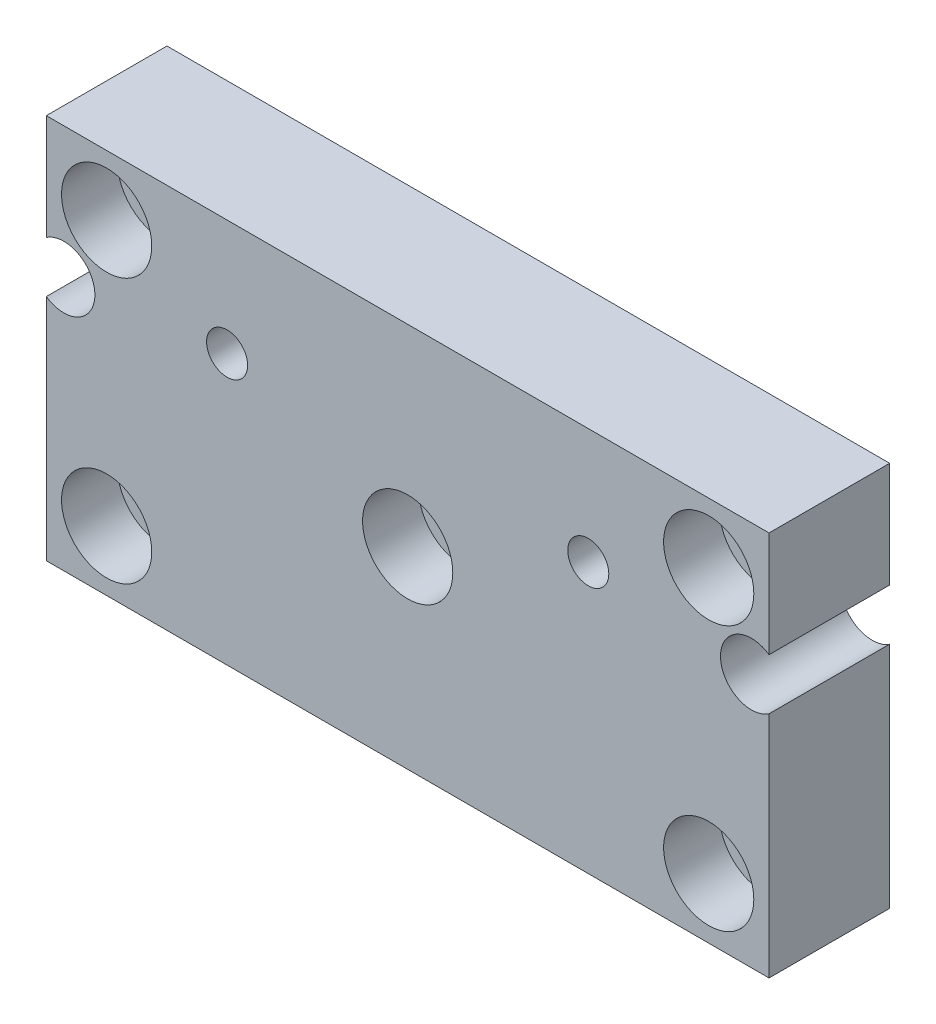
ISO-10303-21;
HEADER;
FILE_DESCRIPTION(('STEP AP214'),'2;1');
FILE_NAME('part.step','',(''),(''),'','','');
FILE_SCHEMA(('AUTOMOTIVE_DESIGN { 1 0 10303 214 1 1 1 1 }'));
ENDSEC;
DATA;
#1=APPLICATION_CONTEXT('core data for automotive mechanical design processes');
#2=APPLICATION_PROTOCOL_DEFINITION('international standard','automotive_design',2000,#1);
#3=PRODUCT_CONTEXT('',#1,'mechanical');
#4=PRODUCT('Part','Part','',(#3));
#5=PRODUCT_RELATED_PRODUCT_CATEGORY('part','',(#4));
#6=PRODUCT_DEFINITION_FORMATION('','',#4);
#7=PRODUCT_DEFINITION_CONTEXT('part definition',#1,'design');
#8=PRODUCT_DEFINITION('design','',#6,#7);
#9=PRODUCT_DEFINITION_SHAPE('','',#8);
#10=(LENGTH_UNIT() NAMED_UNIT(*) SI_UNIT(.MILLI.,.METRE.));
#11=(NAMED_UNIT(*) PLANE_ANGLE_UNIT() SI_UNIT($,.RADIAN.));
#12=(NAMED_UNIT(*) SI_UNIT($,.STERADIAN.) SOLID_ANGLE_UNIT());
#13=UNCERTAINTY_MEASURE_WITH_UNIT(LENGTH_MEASURE(1.E-05),#10,'distance_accuracy_value','');
#14=(GEOMETRIC_REPRESENTATION_CONTEXT(3) GLOBAL_UNCERTAINTY_ASSIGNED_CONTEXT((#13)) GLOBAL_UNIT_ASSIGNED_CONTEXT((#10,
#11,#12)) REPRESENTATION_CONTEXT('',''));
#15=CARTESIAN_POINT('',(0.,0.,0.));
#16=DIRECTION('',(0.,0.,1.));
#17=DIRECTION('',(1.,0.,0.));
#18=AXIS2_PLACEMENT_3D('',#15,#16,#17);
#19=CARTESIAN_POINT('',(-23.8125,12.7,-7.9502));
#20=DIRECTION('',(-1.,0.,0.));
#21=DIRECTION('',(0.,-1.,0.));
#22=AXIS2_PLACEMENT_3D('',#19,#20,#21);
#23=PLANE('',#22);
#24=DIRECTION('',(0.,0.,1.));
#25=VECTOR('',#24,1.);
#26=CARTESIAN_POINT('',(-23.8125,2.37724109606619,-7.9502));
#27=LINE('',#26,#25);
#28=CARTESIAN_POINT('',(-23.8125,2.37724109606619,-7.9502));
#29=VERTEX_POINT('',#28);
#30=CARTESIAN_POINT('',(-23.8125,2.37724109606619,0.));
#31=VERTEX_POINT('',#30);
#32=EDGE_CURVE('E50',#29,#31,#27,.T.);
#33=ORIENTED_EDGE('',*,*,#32,.F.);
#34=DIRECTION('',(0.,-1.,0.));
#35=VECTOR('',#34,1.);
#36=CARTESIAN_POINT('',(-23.8125,12.7,-7.9502));
#37=LINE('',#36,#35);
#38=CARTESIAN_POINT('',(-23.8125,-12.7,-7.9502));
#39=VERTEX_POINT('',#38);
#40=EDGE_CURVE('E115',#29,#39,#37,.T.);
#41=ORIENTED_EDGE('',*,*,#40,.T.);
#42=DIRECTION('',(0.,0.,1.));
#43=VECTOR('',#42,1.);
#44=CARTESIAN_POINT('',(-23.8125,-12.7,-7.9502));
#45=LINE('',#44,#43);
#46=CARTESIAN_POINT('',(-23.8125,-12.7,0.));
#47=VERTEX_POINT('',#46);
#48=EDGE_CURVE('E133',#39,#47,#45,.T.);
#49=ORIENTED_EDGE('',*,*,#48,.T.);
#50=DIRECTION('',(0.,-1.,0.));
#51=VECTOR('',#50,1.);
#52=CARTESIAN_POINT('',(-23.8125,12.7,0.));
#53=LINE('',#52,#51);
#54=EDGE_CURVE('E137',#31,#47,#53,.T.);
#55=ORIENTED_EDGE('',*,*,#54,.F.);
#56=EDGE_LOOP('',(#33,#41,#49,#55));
#57=FACE_BOUND('',#56,.T.);
#58=ADVANCED_FACE('F36',(#57),#23,.T.);
#59=CARTESIAN_POINT('',(23.8125,12.7,-7.9502));
#60=DIRECTION('',(1.,0.,0.));
#61=DIRECTION('',(0.,1.,0.));
#62=AXIS2_PLACEMENT_3D('',#59,#60,#61);
#63=PLANE('',#62);
#64=DIRECTION('',(0.,0.,1.));
#65=VECTOR('',#64,1.);
#66=CARTESIAN_POINT('',(23.8125,5.75075890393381,-7.9502));
#67=LINE('',#66,#65);
#68=CARTESIAN_POINT('',(23.8125,5.75075890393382,-7.9502));
#69=VERTEX_POINT('',#68);
#70=CARTESIAN_POINT('',(23.8125,5.75075890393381,0.));
#71=VERTEX_POINT('',#70);
#72=EDGE_CURVE('E58',#69,#71,#67,.T.);
#73=ORIENTED_EDGE('',*,*,#72,.F.);
#74=DIRECTION('',(0.,1.,0.));
#75=VECTOR('',#74,1.);
#76=CARTESIAN_POINT('',(23.8125,12.7,-7.9502));
#77=LINE('',#76,#75);
#78=CARTESIAN_POINT('',(23.8125,12.7,-7.9502));
#79=VERTEX_POINT('',#78);
#80=EDGE_CURVE('E121',#69,#79,#77,.T.);
#81=ORIENTED_EDGE('',*,*,#80,.T.);
#82=DIRECTION('',(0.,0.,1.));
#83=VECTOR('',#82,1.);
#84=CARTESIAN_POINT('',(23.8125,12.7,-7.9502));
#85=LINE('',#84,#83);
#86=CARTESIAN_POINT('',(23.8125,12.7,0.));
#87=VERTEX_POINT('',#86);
#88=EDGE_CURVE('E147',#79,#87,#85,.T.);
#89=ORIENTED_EDGE('',*,*,#88,.T.);
#90=DIRECTION('',(0.,1.,0.));
#91=VECTOR('',#90,1.);
#92=CARTESIAN_POINT('',(23.8125,12.7,0.));
#93=LINE('',#92,#91);
#94=EDGE_CURVE('E140',#71,#87,#93,.T.);
#95=ORIENTED_EDGE('',*,*,#94,.F.);
#96=EDGE_LOOP('',(#73,#81,#89,#95));
#97=FACE_BOUND('',#96,.T.);
#98=ADVANCED_FACE('F239',(#97),#63,.T.);
#99=CARTESIAN_POINT('',(0.,0.,-7.9502));
#100=DIRECTION('',(0.,0.,1.));
#101=DIRECTION('',(1.,0.,0.));
#102=AXIS2_PLACEMENT_3D('',#99,#100,#101);
#103=CYLINDRICAL_SURFACE('',#102,1.778);
#104=CARTESIAN_POINT('',(0.,0.,-7.9502));
#105=DIRECTION('',(0.,0.,1.));
#106=DIRECTION('',(1.,0.,0.));
#107=AXIS2_PLACEMENT_3D('',#104,#105,#106);
#108=CIRCLE('',#107,1.778);
#109=CARTESIAN_POINT('',(1.778,0.,-7.9502));
#110=VERTEX_POINT('',#109);
#111=EDGE_CURVE('E157',#110,#110,#108,.T.);
#112=ORIENTED_EDGE('',*,*,#111,.F.);
#113=EDGE_LOOP('',(#112));
#114=FACE_BOUND('',#113,.T.);
#115=CARTESIAN_POINT('',(0.,0.,-3.683));
#116=DIRECTION('',(0.,0.,1.));
#117=DIRECTION('',(1.,0.,0.));
#118=AXIS2_PLACEMENT_3D('',#115,#116,#117);
#119=CIRCLE('',#118,1.778);
#120=CARTESIAN_POINT('',(1.778,0.,-3.683));
#121=VERTEX_POINT('',#120);
#122=EDGE_CURVE('E173',#121,#121,#119,.F.);
#123=ORIENTED_EDGE('',*,*,#122,.F.);
#124=EDGE_LOOP('',(#123));
#125=FACE_BOUND('',#124,.T.);
#126=ADVANCED_FACE('F289',(#114,#125),#103,.F.);
#127=CARTESIAN_POINT('',(-19.8374,8.7249,-7.9502));
#128=DIRECTION('',(0.,0.,1.));
#129=DIRECTION('',(1.,0.,0.));
#130=AXIS2_PLACEMENT_3D('',#127,#128,#129);
#131=CYLINDRICAL_SURFACE('',#130,1.778);
#132=CARTESIAN_POINT('',(-19.8374,8.7249,-7.9502));
#133=DIRECTION('',(0.,0.,1.));
#134=DIRECTION('',(1.,0.,0.));
#135=AXIS2_PLACEMENT_3D('',#132,#133,#134);
#136=CIRCLE('',#135,1.778);
#137=CARTESIAN_POINT('',(-18.0594,8.7249,-7.9502));
#138=VERTEX_POINT('',#137);
#139=EDGE_CURVE('E207',#138,#138,#136,.T.);
#140=ORIENTED_EDGE('',*,*,#139,.F.);
#141=EDGE_LOOP('',(#140));
#142=FACE_BOUND('',#141,.T.);
#143=CARTESIAN_POINT('',(-19.8374,8.7249,-3.683));
#144=DIRECTION('',(0.,0.,1.));
#145=DIRECTION('',(1.,0.,0.));
#146=AXIS2_PLACEMENT_3D('',#143,#144,#145);
#147=CIRCLE('',#146,1.778);
#148=CARTESIAN_POINT('',(-18.0594,8.7249,-3.683));
#149=VERTEX_POINT('',#148);
#150=EDGE_CURVE('E169',#149,#149,#147,.F.);
#151=ORIENTED_EDGE('',*,*,#150,.F.);
#152=EDGE_LOOP('',(#151));
#153=FACE_BOUND('',#152,.T.);
#154=ADVANCED_FACE('F468',(#142,#153),#131,.F.);
#155=CARTESIAN_POINT('',(-19.8374,-8.7249,-7.9502));
#156=DIRECTION('',(0.,0.,1.));
#157=DIRECTION('',(1.,0.,0.));
#158=AXIS2_PLACEMENT_3D('',#155,#156,#157);
#159=CYLINDRICAL_SURFACE('',#158,1.778);
#160=CARTESIAN_POINT('',(-19.8374,-8.7249,-7.9502));
#161=DIRECTION('',(0.,0.,1.));
#162=DIRECTION('',(1.,0.,0.));
#163=AXIS2_PLACEMENT_3D('',#160,#161,#162);
#164=CIRCLE('',#163,1.778);
#165=CARTESIAN_POINT('',(-18.0594,-8.7249,-7.9502));
#166=VERTEX_POINT('',#165);
#167=EDGE_CURVE('E210',#166,#166,#164,.T.);
#168=ORIENTED_EDGE('',*,*,#167,.F.);
#169=EDGE_LOOP('',(#168));
#170=FACE_BOUND('',#169,.T.);
#171=CARTESIAN_POINT('',(-19.8374,-8.7249,-3.683));
#172=DIRECTION('',(0.,0.,1.));
#173=DIRECTION('',(1.,0.,0.));
#174=AXIS2_PLACEMENT_3D('',#171,#172,#173);
#175=CIRCLE('',#174,1.778);
#176=CARTESIAN_POINT('',(-18.0594,-8.7249,-3.683));
#177=VERTEX_POINT('',#176);
#178=EDGE_CURVE('E164',#177,#177,#175,.F.);
#179=ORIENTED_EDGE('',*,*,#178,.F.);
#180=EDGE_LOOP('',(#179));
#181=FACE_BOUND('',#180,.T.);
#182=ADVANCED_FACE('F304',(#170,#181),#159,.F.);
#183=CARTESIAN_POINT('',(19.8374,-8.7249,-7.9502));
#184=DIRECTION('',(0.,0.,1.));
#185=DIRECTION('',(1.,0.,0.));
#186=AXIS2_PLACEMENT_3D('',#183,#184,#185);
#187=CYLINDRICAL_SURFACE('',#186,1.778);
#188=CARTESIAN_POINT('',(19.8374,-8.7249,-7.9502));
#189=DIRECTION('',(0.,0.,1.));
#190=DIRECTION('',(1.,0.,0.));
#191=AXIS2_PLACEMENT_3D('',#188,#189,#190);
#192=CIRCLE('',#191,1.778);
#193=CARTESIAN_POINT('',(21.6154,-8.7249,-7.9502));
#194=VERTEX_POINT('',#193);
#195=EDGE_CURVE('E212',#194,#194,#192,.T.);
#196=ORIENTED_EDGE('',*,*,#195,.F.);
#197=EDGE_LOOP('',(#196));
#198=FACE_BOUND('',#197,.T.);
#199=CARTESIAN_POINT('',(19.8374,-8.7249,-3.683));
#200=DIRECTION('',(0.,0.,1.));
#201=DIRECTION('',(1.,0.,0.));
#202=AXIS2_PLACEMENT_3D('',#199,#200,#201);
#203=CIRCLE('',#202,1.778);
#204=CARTESIAN_POINT('',(21.6154,-8.7249,-3.683));
#205=VERTEX_POINT('',#204);
#206=EDGE_CURVE('E159',#205,#205,#203,.F.);
#207=ORIENTED_EDGE('',*,*,#206,.F.);
#208=EDGE_LOOP('',(#207));
#209=FACE_BOUND('',#208,.T.);
#210=ADVANCED_FACE('F298',(#198,#209),#187,.F.);
#211=CARTESIAN_POINT('',(19.8374,8.7249,-7.9502));
#212=DIRECTION('',(0.,0.,1.));
#213=DIRECTION('',(1.,0.,0.));
#214=AXIS2_PLACEMENT_3D('',#211,#212,#213);
#215=CYLINDRICAL_SURFACE('',#214,1.778);
#216=CARTESIAN_POINT('',(19.8374,8.7249,-7.9502));
#217=DIRECTION('',(0.,0.,1.));
#218=DIRECTION('',(1.,0.,0.));
#219=AXIS2_PLACEMENT_3D('',#216,#217,#218);
#220=CIRCLE('',#219,1.778);
#221=CARTESIAN_POINT('',(21.6154,8.7249,-7.9502));
#222=VERTEX_POINT('',#221);
#223=EDGE_CURVE('E125',#222,#222,#220,.T.);
#224=ORIENTED_EDGE('',*,*,#223,.F.);
#225=EDGE_LOOP('',(#224));
#226=FACE_BOUND('',#225,.T.);
#227=CARTESIAN_POINT('',(19.8374,8.7249,-3.683));
#228=DIRECTION('',(0.,0.,1.));
#229=DIRECTION('',(1.,0.,0.));
#230=AXIS2_PLACEMENT_3D('',#227,#228,#229);
#231=CIRCLE('',#230,1.778);
#232=CARTESIAN_POINT('',(21.6154,8.7249,-3.683));
#233=VERTEX_POINT('',#232);
#234=EDGE_CURVE('E154',#233,#233,#231,.F.);
#235=ORIENTED_EDGE('',*,*,#234,.F.);
#236=EDGE_LOOP('',(#235));
#237=FACE_BOUND('',#236,.T.);
#238=ADVANCED_FACE('F292',(#226,#237),#215,.F.);
#239=DIRECTION('',(0.,0.,1.));
#240=VECTOR('',#239,1.);
#241=CARTESIAN_POINT('',(-23.8125,5.75075890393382,-7.9502));
#242=LINE('',#241,#240);
#243=CARTESIAN_POINT('',(-23.8125,5.75075890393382,0.));
#244=VERTEX_POINT('',#243);
#245=CARTESIAN_POINT('',(-23.8125,5.75075890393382,-7.9502));
#246=VERTEX_POINT('',#245);
#247=EDGE_CURVE('E98',#244,#246,#242,.F.);
#248=ORIENTED_EDGE('',*,*,#247,.F.);
#249=CARTESIAN_POINT('',(-23.8125,12.7,0.));
#250=VERTEX_POINT('',#249);
#251=EDGE_CURVE('E134',#250,#244,#53,.T.);
#252=ORIENTED_EDGE('',*,*,#251,.F.);
#253=DIRECTION('',(0.,0.,1.));
#254=VECTOR('',#253,1.);
#255=CARTESIAN_POINT('',(-23.8125,12.7,-7.9502));
#256=LINE('',#255,#254);
#257=CARTESIAN_POINT('',(-23.8125,12.7,-7.9502));
#258=VERTEX_POINT('',#257);
#259=EDGE_CURVE('E44',#258,#250,#256,.T.);
#260=ORIENTED_EDGE('',*,*,#259,.F.);
#261=EDGE_CURVE('E112',#258,#246,#37,.T.);
#262=ORIENTED_EDGE('',*,*,#261,.T.);
#263=EDGE_LOOP('',(#248,#252,#260,#262));
#264=FACE_BOUND('',#263,.T.);
#265=ADVANCED_FACE('F38',(#264),#23,.T.);
#266=CARTESIAN_POINT('',(-23.8125,12.7,-7.9502));
#267=DIRECTION('',(0.,1.,0.));
#268=DIRECTION('',(-1.,0.,0.));
#269=AXIS2_PLACEMENT_3D('',#266,#267,#268);
#270=PLANE('',#269);
#271=DIRECTION('',(-1.,0.,0.));
#272=VECTOR('',#271,1.);
#273=CARTESIAN_POINT('',(-23.8125,12.7,0.));
#274=LINE('',#273,#272);
#275=EDGE_CURVE('E123',#87,#250,#274,.T.);
#276=ORIENTED_EDGE('',*,*,#275,.F.);
#277=ORIENTED_EDGE('',*,*,#88,.F.);
#278=DIRECTION('',(-1.,0.,0.));
#279=VECTOR('',#278,1.);
#280=CARTESIAN_POINT('',(-23.8125,12.7,-7.9502));
#281=LINE('',#280,#279);
#282=EDGE_CURVE('E131',#79,#258,#281,.T.);
#283=ORIENTED_EDGE('',*,*,#282,.T.);
#284=ORIENTED_EDGE('',*,*,#259,.T.);
#285=EDGE_LOOP('',(#276,#277,#283,#284));
#286=FACE_BOUND('',#285,.T.);
#287=ADVANCED_FACE('F244',(#286),#270,.T.);
#288=DIRECTION('',(0.,0.,1.));
#289=VECTOR('',#288,1.);
#290=CARTESIAN_POINT('',(23.8125,2.37724109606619,-7.9502));
#291=LINE('',#290,#289);
#292=CARTESIAN_POINT('',(23.8125,2.37724109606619,0.));
#293=VERTEX_POINT('',#292);
#294=CARTESIAN_POINT('',(23.8125,2.37724109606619,-7.9502));
#295=VERTEX_POINT('',#294);
#296=EDGE_CURVE('E233',#293,#295,#291,.F.);
#297=ORIENTED_EDGE('',*,*,#296,.F.);
#298=CARTESIAN_POINT('',(23.8125,-12.7,0.));
#299=VERTEX_POINT('',#298);
#300=EDGE_CURVE('E141',#299,#293,#93,.T.);
#301=ORIENTED_EDGE('',*,*,#300,.F.);
#302=DIRECTION('',(0.,0.,1.));
#303=VECTOR('',#302,1.);
#304=CARTESIAN_POINT('',(23.8125,-12.7,-7.9502));
#305=LINE('',#304,#303);
#306=CARTESIAN_POINT('',(23.8125,-12.7,-7.9502));
#307=VERTEX_POINT('',#306);
#308=EDGE_CURVE('E150',#307,#299,#305,.T.);
#309=ORIENTED_EDGE('',*,*,#308,.F.);
#310=EDGE_CURVE('E128',#307,#295,#77,.T.);
#311=ORIENTED_EDGE('',*,*,#310,.T.);
#312=EDGE_LOOP('',(#297,#301,#309,#311));
#313=FACE_BOUND('',#312,.T.);
#314=ADVANCED_FACE('F232',(#313),#63,.T.);
#315=CARTESIAN_POINT('',(-23.8125,-12.7,-7.9502));
#316=DIRECTION('',(0.,-1.,0.));
#317=DIRECTION('',(1.,0.,0.));
#318=AXIS2_PLACEMENT_3D('',#315,#316,#317);
#319=PLANE('',#318);
#320=DIRECTION('',(1.,0.,0.));
#321=VECTOR('',#320,1.);
#322=CARTESIAN_POINT('',(-23.8125,-12.7,0.));
#323=LINE('',#322,#321);
#324=EDGE_CURVE('E136',#47,#299,#323,.T.);
#325=ORIENTED_EDGE('',*,*,#324,.F.);
#326=ORIENTED_EDGE('',*,*,#48,.F.);
#327=DIRECTION('',(1.,0.,0.));
#328=VECTOR('',#327,1.);
#329=CARTESIAN_POINT('',(-23.8125,-12.7,-7.9502));
#330=LINE('',#329,#328);
#331=EDGE_CURVE('E118',#39,#307,#330,.T.);
#332=ORIENTED_EDGE('',*,*,#331,.T.);
#333=ORIENTED_EDGE('',*,*,#308,.T.);
#334=EDGE_LOOP('',(#325,#326,#332,#333));
#335=FACE_BOUND('',#334,.T.);
#336=ADVANCED_FACE('F227',(#335),#319,.T.);
#337=CARTESIAN_POINT('',(-23.8125,-12.7,-7.9502));
#338=DIRECTION('',(0.,0.,1.));
#339=DIRECTION('',(1.,0.,0.));
#340=AXIS2_PLACEMENT_3D('',#337,#338,#339);
#341=PLANE('',#340);
#342=CARTESIAN_POINT('',(-11.8999,5.07999999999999,-7.9502));
#343=DIRECTION('',(0.,0.,1.));
#344=DIRECTION('',(1.,0.,0.));
#345=AXIS2_PLACEMENT_3D('',#342,#343,#344);
#346=CIRCLE('',#345,1.35255);
#347=CARTESIAN_POINT('',(-10.54735,5.07999999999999,-7.9502));
#348=VERTEX_POINT('',#347);
#349=EDGE_CURVE('E257',#348,#348,#346,.T.);
#350=ORIENTED_EDGE('',*,*,#349,.T.);
#351=EDGE_LOOP('',(#350));
#352=FACE_BOUND('',#351,.T.);
#353=CARTESIAN_POINT('',(11.8999,5.07999999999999,-7.9502));
#354=DIRECTION('',(0.,0.,1.));
#355=DIRECTION('',(1.,0.,0.));
#356=AXIS2_PLACEMENT_3D('',#353,#354,#355);
#357=CIRCLE('',#356,1.35255);
#358=CARTESIAN_POINT('',(13.25245,5.07999999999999,-7.9502));
#359=VERTEX_POINT('',#358);
#360=EDGE_CURVE('E251',#359,#359,#357,.T.);
#361=ORIENTED_EDGE('',*,*,#360,.T.);
#362=EDGE_LOOP('',(#361));
#363=FACE_BOUND('',#362,.T.);
#364=ORIENTED_EDGE('',*,*,#111,.T.);
#365=EDGE_LOOP('',(#364));
#366=FACE_BOUND('',#365,.T.);
#367=ORIENTED_EDGE('',*,*,#139,.T.);
#368=EDGE_LOOP('',(#367));
#369=FACE_BOUND('',#368,.T.);
#370=ORIENTED_EDGE('',*,*,#167,.T.);
#371=EDGE_LOOP('',(#370));
#372=FACE_BOUND('',#371,.T.);
#373=ORIENTED_EDGE('',*,*,#195,.T.);
#374=EDGE_LOOP('',(#373));
#375=FACE_BOUND('',#374,.T.);
#376=ORIENTED_EDGE('',*,*,#223,.T.);
#377=EDGE_LOOP('',(#376));
#378=FACE_BOUND('',#377,.T.);
#379=ORIENTED_EDGE('',*,*,#40,.F.);
#380=CARTESIAN_POINT('',(-22.6568,4.064,-7.9502));
#381=DIRECTION('',(0.,0.,1.));
#382=DIRECTION('',(1.,0.,0.));
#383=AXIS2_PLACEMENT_3D('',#380,#381,#382);
#384=CIRCLE('',#383,2.0447);
#385=EDGE_CURVE('E101',#29,#246,#384,.T.);
#386=ORIENTED_EDGE('',*,*,#385,.T.);
#387=ORIENTED_EDGE('',*,*,#261,.F.);
#388=ORIENTED_EDGE('',*,*,#282,.F.);
#389=ORIENTED_EDGE('',*,*,#80,.F.);
#390=CARTESIAN_POINT('',(22.6568,4.064,-7.9502));
#391=DIRECTION('',(0.,0.,1.));
#392=DIRECTION('',(1.,0.,0.));
#393=AXIS2_PLACEMENT_3D('',#390,#391,#392);
#394=CIRCLE('',#393,2.0447);
#395=EDGE_CURVE('E236',#69,#295,#394,.T.);
#396=ORIENTED_EDGE('',*,*,#395,.T.);
#397=ORIENTED_EDGE('',*,*,#310,.F.);
#398=ORIENTED_EDGE('',*,*,#331,.F.);
#399=EDGE_LOOP('',(#379,#386,#387,#388,#389,#396,#397,#398));
#400=FACE_BOUND('',#399,.T.);
#401=ADVANCED_FACE('F110',(#352,#363,#366,#369,#372,#375,#378,#400),#341,.F.);
#402=CARTESIAN_POINT('',(-23.8125,-12.7,0.));
#403=DIRECTION('',(0.,0.,1.));
#404=DIRECTION('',(1.,0.,0.));
#405=AXIS2_PLACEMENT_3D('',#402,#403,#404);
#406=PLANE('',#405);
#407=CARTESIAN_POINT('',(-11.8999,5.07999999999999,0.));
#408=DIRECTION('',(0.,0.,1.));
#409=DIRECTION('',(1.,0.,0.));
#410=AXIS2_PLACEMENT_3D('',#407,#408,#409);
#411=CIRCLE('',#410,1.35254999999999);
#412=CARTESIAN_POINT('',(-10.54735,5.07999999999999,0.));
#413=VERTEX_POINT('',#412);
#414=EDGE_CURVE('E254',#413,#413,#411,.T.);
#415=ORIENTED_EDGE('',*,*,#414,.F.);
#416=EDGE_LOOP('',(#415));
#417=FACE_BOUND('',#416,.T.);
#418=CARTESIAN_POINT('',(11.8999,5.07999999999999,0.));
#419=DIRECTION('',(0.,0.,1.));
#420=DIRECTION('',(1.,0.,0.));
#421=AXIS2_PLACEMENT_3D('',#418,#419,#420);
#422=CIRCLE('',#421,1.35254999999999);
#423=CARTESIAN_POINT('',(13.25245,5.07999999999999,0.));
#424=VERTEX_POINT('',#423);
#425=EDGE_CURVE('E116',#424,#424,#422,.T.);
#426=ORIENTED_EDGE('',*,*,#425,.F.);
#427=EDGE_LOOP('',(#426));
#428=FACE_BOUND('',#427,.T.);
#429=CARTESIAN_POINT('',(-22.6568,4.064,0.));
#430=DIRECTION('',(0.,0.,1.));
#431=DIRECTION('',(1.,0.,0.));
#432=AXIS2_PLACEMENT_3D('',#429,#430,#431);
#433=CIRCLE('',#432,2.0447);
#434=EDGE_CURVE('E11',#31,#244,#433,.T.);
#435=ORIENTED_EDGE('',*,*,#434,.F.);
#436=ORIENTED_EDGE('',*,*,#54,.T.);
#437=ORIENTED_EDGE('',*,*,#324,.T.);
#438=ORIENTED_EDGE('',*,*,#300,.T.);
#439=CARTESIAN_POINT('',(22.6568,4.064,0.));
#440=DIRECTION('',(0.,0.,1.));
#441=DIRECTION('',(1.,0.,0.));
#442=AXIS2_PLACEMENT_3D('',#439,#440,#441);
#443=CIRCLE('',#442,2.0447);
#444=EDGE_CURVE('E234',#71,#293,#443,.T.);
#445=ORIENTED_EDGE('',*,*,#444,.F.);
#446=ORIENTED_EDGE('',*,*,#94,.T.);
#447=ORIENTED_EDGE('',*,*,#275,.T.);
#448=ORIENTED_EDGE('',*,*,#251,.T.);
#449=EDGE_LOOP('',(#435,#436,#437,#438,#445,#446,#447,#448));
#450=FACE_BOUND('',#449,.T.);
#451=CARTESIAN_POINT('',(0.,0.,0.));
#452=DIRECTION('',(0.,0.,1.));
#453=DIRECTION('',(1.,0.,0.));
#454=AXIS2_PLACEMENT_3D('',#451,#452,#453);
#455=CIRCLE('',#454,2.9718);
#456=CARTESIAN_POINT('',(2.9718,0.,0.));
#457=VERTEX_POINT('',#456);
#458=EDGE_CURVE('E182',#457,#457,#455,.T.);
#459=ORIENTED_EDGE('',*,*,#458,.F.);
#460=EDGE_LOOP('',(#459));
#461=FACE_BOUND('',#460,.T.);
#462=CARTESIAN_POINT('',(-19.8374,8.7249,0.));
#463=DIRECTION('',(0.,0.,1.));
#464=DIRECTION('',(1.,0.,0.));
#465=AXIS2_PLACEMENT_3D('',#462,#463,#464);
#466=CIRCLE('',#465,2.9718);
#467=CARTESIAN_POINT('',(-16.8656,8.7249,0.));
#468=VERTEX_POINT('',#467);
#469=EDGE_CURVE('E175',#468,#468,#466,.T.);
#470=ORIENTED_EDGE('',*,*,#469,.F.);
#471=EDGE_LOOP('',(#470));
#472=FACE_BOUND('',#471,.T.);
#473=CARTESIAN_POINT('',(-19.8374,-8.7249,0.));
#474=DIRECTION('',(0.,0.,1.));
#475=DIRECTION('',(1.,0.,0.));
#476=AXIS2_PLACEMENT_3D('',#473,#474,#475);
#477=CIRCLE('',#476,2.9718);
#478=CARTESIAN_POINT('',(-16.8656,-8.7249,0.));
#479=VERTEX_POINT('',#478);
#480=EDGE_CURVE('E171',#479,#479,#477,.T.);
#481=ORIENTED_EDGE('',*,*,#480,.F.);
#482=EDGE_LOOP('',(#481));
#483=FACE_BOUND('',#482,.T.);
#484=CARTESIAN_POINT('',(19.8374,-8.7249,0.));
#485=DIRECTION('',(0.,0.,1.));
#486=DIRECTION('',(1.,0.,0.));
#487=AXIS2_PLACEMENT_3D('',#484,#485,#486);
#488=CIRCLE('',#487,2.9718);
#489=CARTESIAN_POINT('',(22.8092,-8.7249,0.));
#490=VERTEX_POINT('',#489);
#491=EDGE_CURVE('E167',#490,#490,#488,.T.);
#492=ORIENTED_EDGE('',*,*,#491,.F.);
#493=EDGE_LOOP('',(#492));
#494=FACE_BOUND('',#493,.T.);
#495=CARTESIAN_POINT('',(19.8374,8.7249,0.));
#496=DIRECTION('',(0.,0.,1.));
#497=DIRECTION('',(1.,0.,0.));
#498=AXIS2_PLACEMENT_3D('',#495,#496,#497);
#499=CIRCLE('',#498,2.9718);
#500=CARTESIAN_POINT('',(22.8092,8.7249,0.));
#501=VERTEX_POINT('',#500);
#502=EDGE_CURVE('E162',#501,#501,#499,.T.);
#503=ORIENTED_EDGE('',*,*,#502,.F.);
#504=EDGE_LOOP('',(#503));
#505=FACE_BOUND('',#504,.T.);
#506=ADVANCED_FACE('F221',(#417,#428,#450,#461,#472,#483,#494,#505),#406,.T.);
#507=CARTESIAN_POINT('',(19.8374,8.7249,-3.683));
#508=DIRECTION('',(0.,0.,1.));
#509=DIRECTION('',(1.,0.,0.));
#510=AXIS2_PLACEMENT_3D('',#507,#508,#509);
#511=PLANE('',#510);
#512=CARTESIAN_POINT('',(19.8374,8.7249,-3.683));
#513=DIRECTION('',(0.,0.,1.));
#514=DIRECTION('',(1.,0.,0.));
#515=AXIS2_PLACEMENT_3D('',#512,#513,#514);
#516=CIRCLE('',#515,2.9718);
#517=CARTESIAN_POINT('',(22.8092,8.7249,-3.683));
#518=VERTEX_POINT('',#517);
#519=EDGE_CURVE('E158',#518,#518,#516,.T.);
#520=ORIENTED_EDGE('',*,*,#519,.T.);
#521=EDGE_LOOP('',(#520));
#522=FACE_BOUND('',#521,.T.);
#523=ORIENTED_EDGE('',*,*,#234,.T.);
#524=EDGE_LOOP('',(#523));
#525=FACE_BOUND('',#524,.T.);
#526=ADVANCED_FACE('F272',(#522,#525),#511,.T.);
#527=CARTESIAN_POINT('',(19.8374,8.7249,-3.683));
#528=DIRECTION('',(0.,0.,1.));
#529=DIRECTION('',(1.,0.,0.));
#530=AXIS2_PLACEMENT_3D('',#527,#528,#529);
#531=CYLINDRICAL_SURFACE('',#530,2.9718);
#532=ORIENTED_EDGE('',*,*,#519,.F.);
#533=EDGE_LOOP('',(#532));
#534=FACE_BOUND('',#533,.T.);
#535=ORIENTED_EDGE('',*,*,#502,.T.);
#536=EDGE_LOOP('',(#535));
#537=FACE_BOUND('',#536,.T.);
#538=ADVANCED_FACE('F335',(#534,#537),#531,.F.);
#539=CARTESIAN_POINT('',(19.8374,-8.7249,-3.683));
#540=DIRECTION('',(0.,0.,1.));
#541=DIRECTION('',(1.,0.,0.));
#542=AXIS2_PLACEMENT_3D('',#539,#540,#541);
#543=PLANE('',#542);
#544=CARTESIAN_POINT('',(19.8374,-8.7249,-3.683));
#545=DIRECTION('',(0.,0.,1.));
#546=DIRECTION('',(1.,0.,0.));
#547=AXIS2_PLACEMENT_3D('',#544,#545,#546);
#548=CIRCLE('',#547,2.9718);
#549=CARTESIAN_POINT('',(22.8092,-8.7249,-3.683));
#550=VERTEX_POINT('',#549);
#551=EDGE_CURVE('E163',#550,#550,#548,.T.);
#552=ORIENTED_EDGE('',*,*,#551,.T.);
#553=EDGE_LOOP('',(#552));
#554=FACE_BOUND('',#553,.T.);
#555=ORIENTED_EDGE('',*,*,#206,.T.);
#556=EDGE_LOOP('',(#555));
#557=FACE_BOUND('',#556,.T.);
#558=ADVANCED_FACE('F343',(#554,#557),#543,.T.);
#559=CARTESIAN_POINT('',(19.8374,-8.7249,-3.683));
#560=DIRECTION('',(0.,0.,1.));
#561=DIRECTION('',(1.,0.,0.));
#562=AXIS2_PLACEMENT_3D('',#559,#560,#561);
#563=CYLINDRICAL_SURFACE('',#562,2.9718);
#564=ORIENTED_EDGE('',*,*,#551,.F.);
#565=EDGE_LOOP('',(#564));
#566=FACE_BOUND('',#565,.T.);
#567=ORIENTED_EDGE('',*,*,#491,.T.);
#568=EDGE_LOOP('',(#567));
#569=FACE_BOUND('',#568,.T.);
#570=ADVANCED_FACE('F351',(#566,#569),#563,.F.);
#571=CARTESIAN_POINT('',(-19.8374,-8.7249,-3.683));
#572=DIRECTION('',(0.,0.,1.));
#573=DIRECTION('',(1.,0.,0.));
#574=AXIS2_PLACEMENT_3D('',#571,#572,#573);
#575=PLANE('',#574);
#576=CARTESIAN_POINT('',(-19.8374,-8.7249,-3.683));
#577=DIRECTION('',(0.,0.,1.));
#578=DIRECTION('',(1.,0.,0.));
#579=AXIS2_PLACEMENT_3D('',#576,#577,#578);
#580=CIRCLE('',#579,2.9718);
#581=CARTESIAN_POINT('',(-16.8656,-8.7249,-3.683));
#582=VERTEX_POINT('',#581);
#583=EDGE_CURVE('E168',#582,#582,#580,.T.);
#584=ORIENTED_EDGE('',*,*,#583,.T.);
#585=EDGE_LOOP('',(#584));
#586=FACE_BOUND('',#585,.T.);
#587=ORIENTED_EDGE('',*,*,#178,.T.);
#588=EDGE_LOOP('',(#587));
#589=FACE_BOUND('',#588,.T.);
#590=ADVANCED_FACE('F359',(#586,#589),#575,.T.);
#591=CARTESIAN_POINT('',(-19.8374,-8.7249,-3.683));
#592=DIRECTION('',(0.,0.,1.));
#593=DIRECTION('',(1.,0.,0.));
#594=AXIS2_PLACEMENT_3D('',#591,#592,#593);
#595=CYLINDRICAL_SURFACE('',#594,2.9718);
#596=ORIENTED_EDGE('',*,*,#583,.F.);
#597=EDGE_LOOP('',(#596));
#598=FACE_BOUND('',#597,.T.);
#599=ORIENTED_EDGE('',*,*,#480,.T.);
#600=EDGE_LOOP('',(#599));
#601=FACE_BOUND('',#600,.T.);
#602=ADVANCED_FACE('F367',(#598,#601),#595,.F.);
#603=CARTESIAN_POINT('',(-19.8374,8.7249,-3.683));
#604=DIRECTION('',(0.,0.,1.));
#605=DIRECTION('',(1.,0.,0.));
#606=AXIS2_PLACEMENT_3D('',#603,#604,#605);
#607=PLANE('',#606);
#608=CARTESIAN_POINT('',(-19.8374,8.7249,-3.683));
#609=DIRECTION('',(0.,0.,1.));
#610=DIRECTION('',(1.,0.,0.));
#611=AXIS2_PLACEMENT_3D('',#608,#609,#610);
#612=CIRCLE('',#611,2.9718);
#613=CARTESIAN_POINT('',(-16.8656,8.7249,-3.683));
#614=VERTEX_POINT('',#613);
#615=EDGE_CURVE('E172',#614,#614,#612,.T.);
#616=ORIENTED_EDGE('',*,*,#615,.T.);
#617=EDGE_LOOP('',(#616));
#618=FACE_BOUND('',#617,.T.);
#619=ORIENTED_EDGE('',*,*,#150,.T.);
#620=EDGE_LOOP('',(#619));
#621=FACE_BOUND('',#620,.T.);
#622=ADVANCED_FACE('F375',(#618,#621),#607,.T.);
#623=CARTESIAN_POINT('',(-19.8374,8.7249,-3.683));
#624=DIRECTION('',(0.,0.,1.));
#625=DIRECTION('',(1.,0.,0.));
#626=AXIS2_PLACEMENT_3D('',#623,#624,#625);
#627=CYLINDRICAL_SURFACE('',#626,2.9718);
#628=ORIENTED_EDGE('',*,*,#615,.F.);
#629=EDGE_LOOP('',(#628));
#630=FACE_BOUND('',#629,.T.);
#631=ORIENTED_EDGE('',*,*,#469,.T.);
#632=EDGE_LOOP('',(#631));
#633=FACE_BOUND('',#632,.T.);
#634=ADVANCED_FACE('F383',(#630,#633),#627,.F.);
#635=CARTESIAN_POINT('',(0.,0.,-3.683));
#636=DIRECTION('',(0.,0.,1.));
#637=DIRECTION('',(1.,0.,0.));
#638=AXIS2_PLACEMENT_3D('',#635,#636,#637);
#639=PLANE('',#638);
#640=CARTESIAN_POINT('',(0.,0.,-3.683));
#641=DIRECTION('',(0.,0.,1.));
#642=DIRECTION('',(1.,0.,0.));
#643=AXIS2_PLACEMENT_3D('',#640,#641,#642);
#644=CIRCLE('',#643,2.9718);
#645=CARTESIAN_POINT('',(2.9718,0.,-3.683));
#646=VERTEX_POINT('',#645);
#647=EDGE_CURVE('E176',#646,#646,#644,.T.);
#648=ORIENTED_EDGE('',*,*,#647,.T.);
#649=EDGE_LOOP('',(#648));
#650=FACE_BOUND('',#649,.T.);
#651=ORIENTED_EDGE('',*,*,#122,.T.);
#652=EDGE_LOOP('',(#651));
#653=FACE_BOUND('',#652,.T.);
#654=ADVANCED_FACE('F391',(#650,#653),#639,.T.);
#655=CARTESIAN_POINT('',(0.,0.,-3.683));
#656=DIRECTION('',(0.,0.,1.));
#657=DIRECTION('',(1.,0.,0.));
#658=AXIS2_PLACEMENT_3D('',#655,#656,#657);
#659=CYLINDRICAL_SURFACE('',#658,2.9718);
#660=ORIENTED_EDGE('',*,*,#647,.F.);
#661=EDGE_LOOP('',(#660));
#662=FACE_BOUND('',#661,.T.);
#663=ORIENTED_EDGE('',*,*,#458,.T.);
#664=EDGE_LOOP('',(#663));
#665=FACE_BOUND('',#664,.T.);
#666=ADVANCED_FACE('F399',(#662,#665),#659,.F.);
#667=CARTESIAN_POINT('',(22.6568,4.064,-7.9502));
#668=DIRECTION('',(0.,0.,1.));
#669=DIRECTION('',(1.,0.,0.));
#670=AXIS2_PLACEMENT_3D('',#667,#668,#669);
#671=CYLINDRICAL_SURFACE('',#670,2.0447);
#672=ORIENTED_EDGE('',*,*,#72,.T.);
#673=ORIENTED_EDGE('',*,*,#444,.T.);
#674=ORIENTED_EDGE('',*,*,#296,.T.);
#675=ORIENTED_EDGE('',*,*,#395,.F.);
#676=EDGE_LOOP('',(#672,#673,#674,#675));
#677=FACE_BOUND('',#676,.T.);
#678=ADVANCED_FACE('F282',(#677),#671,.F.);
#679=CARTESIAN_POINT('',(-22.6568,4.064,-7.9502));
#680=DIRECTION('',(0.,0.,1.));
#681=DIRECTION('',(1.,0.,0.));
#682=AXIS2_PLACEMENT_3D('',#679,#680,#681);
#683=CYLINDRICAL_SURFACE('',#682,2.0447);
#684=ORIENTED_EDGE('',*,*,#32,.T.);
#685=ORIENTED_EDGE('',*,*,#434,.T.);
#686=ORIENTED_EDGE('',*,*,#247,.T.);
#687=ORIENTED_EDGE('',*,*,#385,.F.);
#688=EDGE_LOOP('',(#684,#685,#686,#687));
#689=FACE_BOUND('',#688,.T.);
#690=ADVANCED_FACE('F100',(#689),#683,.F.);
#691=CARTESIAN_POINT('',(11.8999,5.07999999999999,0.));
#692=DIRECTION('',(0.,0.,1.));
#693=DIRECTION('',(1.,0.,0.));
#694=AXIS2_PLACEMENT_3D('',#691,#692,#693);
#695=CYLINDRICAL_SURFACE('',#694,1.35254999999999);
#696=ORIENTED_EDGE('',*,*,#360,.F.);
#697=EDGE_LOOP('',(#696));
#698=FACE_BOUND('',#697,.T.);
#699=ORIENTED_EDGE('',*,*,#425,.T.);
#700=EDGE_LOOP('',(#699));
#701=FACE_BOUND('',#700,.T.);
#702=ADVANCED_FACE('F266',(#698,#701),#695,.F.);
#703=CARTESIAN_POINT('',(-11.8999,5.07999999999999,0.));
#704=DIRECTION('',(0.,0.,1.));
#705=DIRECTION('',(1.,0.,0.));
#706=AXIS2_PLACEMENT_3D('',#703,#704,#705);
#707=CYLINDRICAL_SURFACE('',#706,1.35254999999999);
#708=ORIENTED_EDGE('',*,*,#349,.F.);
#709=EDGE_LOOP('',(#708));
#710=FACE_BOUND('',#709,.T.);
#711=ORIENTED_EDGE('',*,*,#414,.T.);
#712=EDGE_LOOP('',(#711));
#713=FACE_BOUND('',#712,.T.);
#714=ADVANCED_FACE('F263',(#710,#713),#707,.F.);
#715=CLOSED_SHELL('',(#58,#98,#126,#154,#182,#210,#238,#265,#287,#314,#336,#401,#506,#526,#538,
#558,#570,#590,#602,#622,#634,#654,#666,#678,#690,#702,#714));
#716=MANIFOLD_SOLID_BREP('B2',#715);
#717=ADVANCED_BREP_SHAPE_REPRESENTATION('',(#18,#716),#14);
#718=SHAPE_DEFINITION_REPRESENTATION(#9,#717);
ENDSEC;
END-ISO-10303-21;
